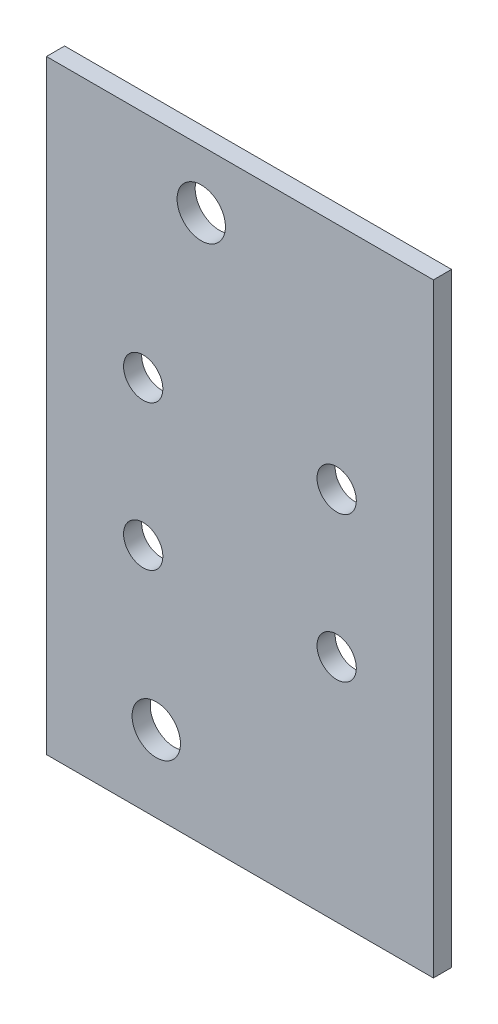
from build123d import *

# Parameters (mm, degrees)
SKETCH1_W          = 203.2
SKETCH1_H          = 317.5
EXTRUDE1_DEPTH     = 9.525
SKETCH3_R          = 10.31875
CUT_EXTRUDE1_DEPTH = 9.525
SKETCH2_R          = 10.31875
CUT_EXTRUDE2_DEPTH = 9.525
SKETCH4_R          = 12.7
CUT_EXTRUDE3_DEPTH = 378.077201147
SKETCH5_R          = 12.7
CUT_EXTRUDE4_DEPTH = 378.077201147


with BuildPart() as part:
    # Sketch1 → Extrude1 (new body)
    with BuildSketch(Plane.XY):
        with Locations((-101.6, -158.75)):
            Rectangle(SKETCH1_W, SKETCH1_H)
    extrude(amount=EXTRUDE1_DEPTH)

    # Sketch3 → Cut-Extrude1 (cut)
    with BuildSketch(Plane.XY.offset(9.525)):
        with Locations((-152.4, -120.65)):
            Circle(SKETCH3_R)
    cut_extrude1 = extrude(amount=-CUT_EXTRUDE1_DEPTH, mode=Mode.SUBTRACT)

    # Sketch2 → Cut-Extrude2 (cut)
    with BuildSketch(Plane.XY.offset(9.525)):
        with Locations((-50.8, -120.65)):
            Circle(SKETCH2_R)
    cut_extrude2 = extrude(amount=-CUT_EXTRUDE2_DEPTH, mode=Mode.SUBTRACT)

    # Mirror1: Cut-Extrude1, Cut-Extrude2 across plane
    add(cut_extrude1.mirror(Plane.ZX.offset(-158.75)), mode=Mode.SUBTRACT)
    add(cut_extrude2.mirror(Plane.ZX.offset(-158.75)), mode=Mode.SUBTRACT)

    # Sketch4 → Cut-Extrude3 (cut, through all)
    with BuildSketch(Plane.XY.offset(9.525)):
        with Locations((-121.92, -30.48)):
            Circle(SKETCH4_R)
    extrude(amount=-CUT_EXTRUDE3_DEPTH, mode=Mode.SUBTRACT)

    # Sketch5 → Cut-Extrude4 (cut, through all)
    with BuildSketch(Plane.XY.offset(9.525)):
        with Locations((-145.542, -277.368)):
            Circle(SKETCH5_R)
    extrude(amount=-CUT_EXTRUDE4_DEPTH, mode=Mode.SUBTRACT)


solid = part.part
